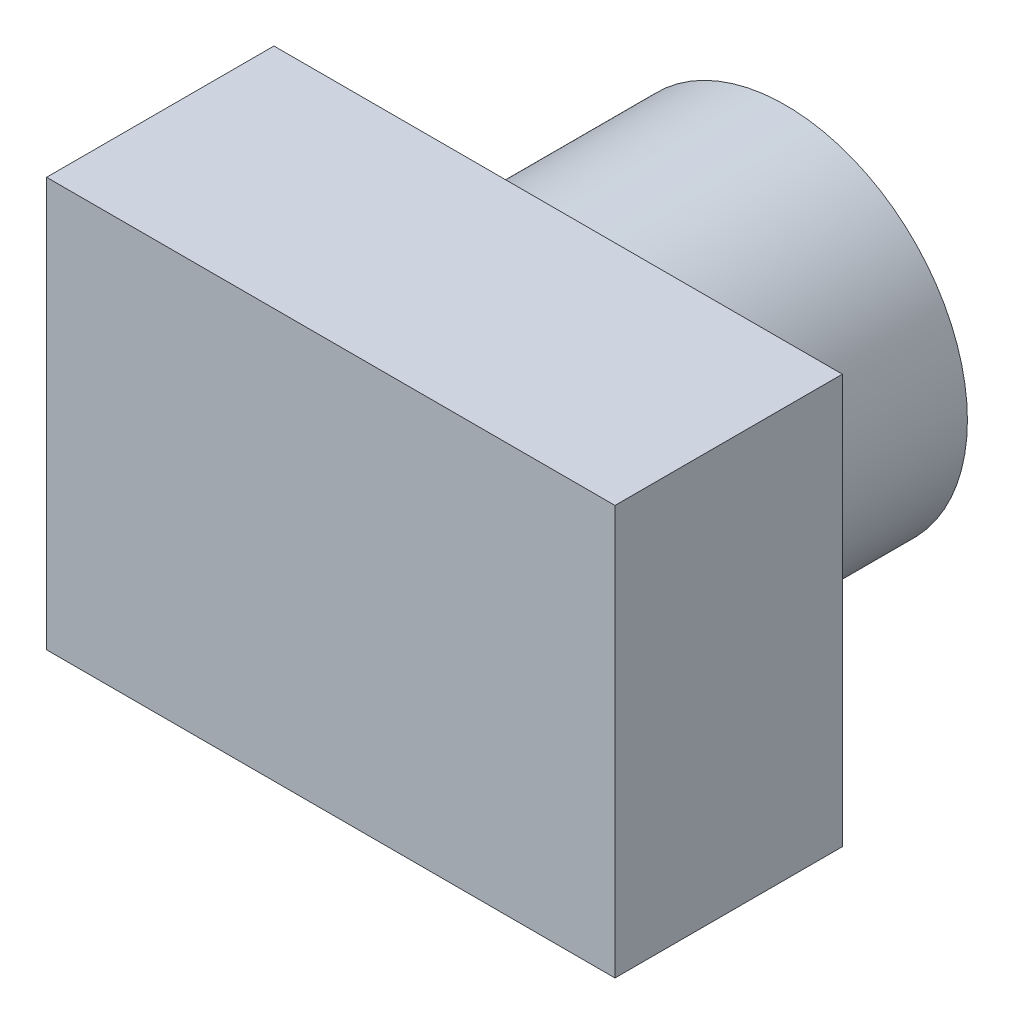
from build123d import *

# Parameters (mm, degrees)
SKETCH_3_W      = 25
SKETCH_3_H      = 18
EXTRUDE_1_DEPTH = 10
SKETCH_4_R      = 8
EXTRUDE_2_DEPTH = 10


with BuildPart() as part:
    # Sketch 3 → Extrude 1 (new body)
    with BuildSketch(Plane.XY):
        with Locations((12.5, -9)):
            Rectangle(SKETCH_3_W, SKETCH_3_H)
    extrude(amount=EXTRUDE_1_DEPTH)

    # Sketch 4 → Extrude 2 (add)
    with BuildSketch(Plane(origin=(0, 0, 0), x_dir=(-1, 0, 0), z_dir=(0, 0, -1))):
        with Locations(Location((-12.5, -9, 0), (0, 0, 180))):
            Circle(SKETCH_4_R)
    extrude(amount=EXTRUDE_2_DEPTH)


solid = part.part
